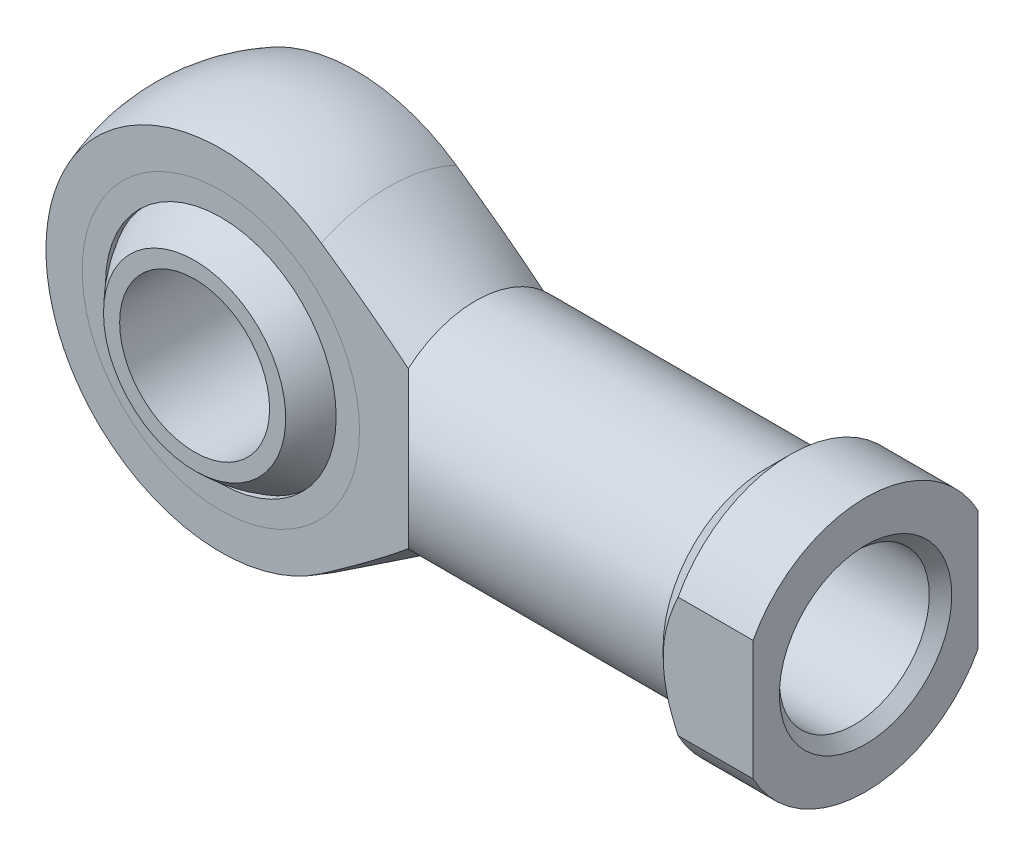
ISO-10303-21;
HEADER;
FILE_DESCRIPTION(('STEP AP214'),'2;1');
FILE_NAME('part.step','',(''),(''),'','','');
FILE_SCHEMA(('AUTOMOTIVE_DESIGN { 1 0 10303 214 1 1 1 1 }'));
ENDSEC;
DATA;
#1=APPLICATION_CONTEXT('core data for automotive mechanical design processes');
#2=APPLICATION_PROTOCOL_DEFINITION('international standard','automotive_design',2000,#1);
#3=PRODUCT_CONTEXT('',#1,'mechanical');
#4=PRODUCT('Part','Part','',(#3));
#5=PRODUCT_RELATED_PRODUCT_CATEGORY('part','',(#4));
#6=PRODUCT_DEFINITION_FORMATION('','',#4);
#7=PRODUCT_DEFINITION_CONTEXT('part definition',#1,'design');
#8=PRODUCT_DEFINITION('design','',#6,#7);
#9=PRODUCT_DEFINITION_SHAPE('','',#8);
#10=(LENGTH_UNIT() NAMED_UNIT(*) SI_UNIT(.MILLI.,.METRE.));
#11=(NAMED_UNIT(*) PLANE_ANGLE_UNIT() SI_UNIT($,.RADIAN.));
#12=(NAMED_UNIT(*) SI_UNIT($,.STERADIAN.) SOLID_ANGLE_UNIT());
#13=UNCERTAINTY_MEASURE_WITH_UNIT(LENGTH_MEASURE(1.E-05),#10,'distance_accuracy_value','');
#14=(GEOMETRIC_REPRESENTATION_CONTEXT(3) GLOBAL_UNCERTAINTY_ASSIGNED_CONTEXT((#13)) GLOBAL_UNIT_ASSIGNED_CONTEXT((#10,
#11,#12)) REPRESENTATION_CONTEXT('',''));
#15=CARTESIAN_POINT('',(0.,0.,0.));
#16=DIRECTION('',(0.,0.,1.));
#17=DIRECTION('',(1.,0.,0.));
#18=AXIS2_PLACEMENT_3D('',#15,#16,#17);
#19=CARTESIAN_POINT('',(0.,0.,0.));
#20=DIRECTION('',(0.,1.,0.));
#21=DIRECTION('',(1.,0.,0.));
#22=AXIS2_PLACEMENT_3D('',#19,#20,#21);
#23=SPHERICAL_SURFACE('',#22,17.435);
#24=CARTESIAN_POINT('',(0.,0.,0.));
#25=DIRECTION('',(0.,0.,-1.));
#26=DIRECTION('',(-1.,0.,0.));
#27=AXIS2_PLACEMENT_3D('',#24,#25,#26);
#28=SPHERICAL_SURFACE('',#27,17.435);
#29=CARTESIAN_POINT('',(0.,0.,12.5));
#30=DIRECTION('',(0.,0.,-1.));
#31=DIRECTION('',(-1.,0.,0.));
#32=AXIS2_PLACEMENT_3D('',#29,#30,#31);
#33=CIRCLE('',#32,12.154391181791);
#34=CARTESIAN_POINT('',(-12.154391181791,0.,12.5));
#35=VERTEX_POINT('',#34);
#36=EDGE_CURVE('P0_E26',#35,#35,#33,.F.);
#37=ORIENTED_EDGE('',*,*,#36,.F.);
#38=EDGE_LOOP('',(#37));
#39=FACE_BOUND('',#38,.T.);
#40=CARTESIAN_POINT('',(0.,0.,-12.5));
#41=DIRECTION('',(0.,0.,1.));
#42=DIRECTION('',(1.,0.,0.));
#43=AXIS2_PLACEMENT_3D('',#40,#41,#42);
#44=CIRCLE('',#43,12.154391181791);
#45=CARTESIAN_POINT('',(12.154391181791,0.,-12.5));
#46=VERTEX_POINT('',#45);
#47=EDGE_CURVE('P0_E10',#46,#46,#44,.F.);
#48=ORIENTED_EDGE('',*,*,#47,.F.);
#49=EDGE_LOOP('',(#48));
#50=FACE_BOUND('',#49,.T.);
#51=ADVANCED_FACE('P0_F14',(#39,#50),#28,.T.);
#52=CARTESIAN_POINT('',(0.,0.,-17.435));
#53=DIRECTION('',(0.,0.,1.));
#54=DIRECTION('',(1.,0.,0.));
#55=AXIS2_PLACEMENT_3D('',#52,#53,#54);
#56=CYLINDRICAL_SURFACE('',#55,10.);
#57=CARTESIAN_POINT('',(0.,0.,12.5));
#58=DIRECTION('',(0.,0.,-1.));
#59=DIRECTION('',(-1.,0.,0.));
#60=AXIS2_PLACEMENT_3D('',#57,#58,#59);
#61=CIRCLE('',#60,10.);
#62=CARTESIAN_POINT('',(-10.,0.,12.5));
#63=VERTEX_POINT('',#62);
#64=EDGE_CURVE('P0_E17',#63,#63,#61,.F.);
#65=ORIENTED_EDGE('',*,*,#64,.T.);
#66=EDGE_LOOP('',(#65));
#67=FACE_BOUND('',#66,.T.);
#68=CARTESIAN_POINT('',(0.,0.,-12.5));
#69=DIRECTION('',(0.,0.,1.));
#70=DIRECTION('',(1.,0.,0.));
#71=AXIS2_PLACEMENT_3D('',#68,#69,#70);
#72=CIRCLE('',#71,10.);
#73=CARTESIAN_POINT('',(10.,0.,-12.5));
#74=VERTEX_POINT('',#73);
#75=EDGE_CURVE('P0_E21',#74,#74,#72,.F.);
#76=ORIENTED_EDGE('',*,*,#75,.T.);
#77=EDGE_LOOP('',(#76));
#78=FACE_BOUND('',#77,.T.);
#79=ADVANCED_FACE('P0_F34',(#67,#78),#56,.F.);
#80=CARTESIAN_POINT('',(-17.435,-17.435,-12.5));
#81=DIRECTION('',(0.,0.,1.));
#82=DIRECTION('',(1.,0.,0.));
#83=AXIS2_PLACEMENT_3D('',#80,#81,#82);
#84=PLANE('',#83);
#85=ORIENTED_EDGE('',*,*,#47,.T.);
#86=EDGE_LOOP('',(#85));
#87=FACE_BOUND('',#86,.T.);
#88=ORIENTED_EDGE('',*,*,#75,.F.);
#89=EDGE_LOOP('',(#88));
#90=FACE_BOUND('',#89,.T.);
#91=ADVANCED_FACE('P0_F39',(#87,#90),#84,.F.);
#92=CARTESIAN_POINT('',(-17.435,-17.435,12.5));
#93=DIRECTION('',(0.,0.,-1.));
#94=DIRECTION('',(-1.,0.,0.));
#95=AXIS2_PLACEMENT_3D('',#92,#93,#94);
#96=PLANE('',#95);
#97=ORIENTED_EDGE('',*,*,#36,.T.);
#98=EDGE_LOOP('',(#97));
#99=FACE_BOUND('',#98,.T.);
#100=ORIENTED_EDGE('',*,*,#64,.F.);
#101=EDGE_LOOP('',(#100));
#102=FACE_BOUND('',#101,.T.);
#103=ADVANCED_FACE('P0_F37',(#99,#102),#96,.F.);
#104=CLOSED_SHELL('',(#51,#79,#91,#103));
#105=MANIFOLD_SOLID_BREP('P0_B1',#104);
#106=CARTESIAN_POINT('',(0.,0.,9.));
#107=DIRECTION('',(0.,0.,1.));
#108=DIRECTION('',(1.,0.,0.));
#109=AXIS2_PLACEMENT_3D('',#106,#107,#108);
#110=PLANE('',#109);
#111=CARTESIAN_POINT('',(0.,0.,9.));
#112=DIRECTION('',(0.,0.,1.));
#113=DIRECTION('',(1.,0.,0.));
#114=AXIS2_PLACEMENT_3D('',#111,#112,#113);
#115=CIRCLE('',#114,18.5);
#116=CARTESIAN_POINT('',(18.5,0.,9.));
#117=VERTEX_POINT('',#116);
#118=EDGE_CURVE('P1_E10',#117,#117,#115,.T.);
#119=ORIENTED_EDGE('',*,*,#118,.T.);
#120=EDGE_LOOP('',(#119));
#121=FACE_BOUND('',#120,.T.);
#122=CARTESIAN_POINT('',(0.,0.,9.));
#123=DIRECTION('',(0.,0.,1.));
#124=DIRECTION('',(1.,0.,0.));
#125=AXIS2_PLACEMENT_3D('',#122,#123,#124);
#126=CIRCLE('',#125,15.385);
#127=CARTESIAN_POINT('',(15.385,0.,9.));
#128=VERTEX_POINT('',#127);
#129=EDGE_CURVE('P1_E25',#128,#128,#126,.T.);
#130=ORIENTED_EDGE('',*,*,#129,.F.);
#131=EDGE_LOOP('',(#130));
#132=FACE_BOUND('',#131,.T.);
#133=ADVANCED_FACE('P1_F14',(#121,#132),#110,.T.);
#134=CARTESIAN_POINT('',(0.,0.,8.2));
#135=DIRECTION('',(0.,0.,1.));
#136=DIRECTION('',(1.,0.,0.));
#137=AXIS2_PLACEMENT_3D('',#134,#135,#136);
#138=PLANE('',#137);
#139=CARTESIAN_POINT('',(0.,0.,8.2));
#140=DIRECTION('',(0.,0.,1.));
#141=DIRECTION('',(1.,0.,0.));
#142=AXIS2_PLACEMENT_3D('',#139,#140,#141);
#143=CIRCLE('',#142,18.5);
#144=CARTESIAN_POINT('',(18.5,0.,8.2));
#145=VERTEX_POINT('',#144);
#146=EDGE_CURVE('P1_E18',#145,#145,#143,.T.);
#147=ORIENTED_EDGE('',*,*,#146,.F.);
#148=EDGE_LOOP('',(#147));
#149=FACE_BOUND('',#148,.T.);
#150=CARTESIAN_POINT('',(0.,0.,8.2));
#151=DIRECTION('',(0.,0.,1.));
#152=DIRECTION('',(1.,0.,0.));
#153=AXIS2_PLACEMENT_3D('',#150,#151,#152);
#154=CIRCLE('',#153,15.385);
#155=CARTESIAN_POINT('',(15.385,0.,8.2));
#156=VERTEX_POINT('',#155);
#157=EDGE_CURVE('P1_E27',#156,#156,#154,.T.);
#158=ORIENTED_EDGE('',*,*,#157,.T.);
#159=EDGE_LOOP('',(#158));
#160=FACE_BOUND('',#159,.T.);
#161=ADVANCED_FACE('P1_F37',(#149,#160),#138,.F.);
#162=CARTESIAN_POINT('',(0.,0.,9.));
#163=DIRECTION('',(0.,0.,-1.));
#164=DIRECTION('',(-1.,0.,0.));
#165=AXIS2_PLACEMENT_3D('',#162,#163,#164);
#166=CYLINDRICAL_SURFACE('',#165,18.5);
#167=ORIENTED_EDGE('',*,*,#118,.F.);
#168=EDGE_LOOP('',(#167));
#169=FACE_BOUND('',#168,.T.);
#170=ORIENTED_EDGE('',*,*,#146,.T.);
#171=EDGE_LOOP('',(#170));
#172=FACE_BOUND('',#171,.T.);
#173=ADVANCED_FACE('P1_F16',(#169,#172),#166,.T.);
#174=CARTESIAN_POINT('',(0.,0.,9.));
#175=DIRECTION('',(0.,0.,-1.));
#176=DIRECTION('',(-1.,0.,0.));
#177=AXIS2_PLACEMENT_3D('',#174,#175,#176);
#178=CYLINDRICAL_SURFACE('',#177,15.385);
#179=ORIENTED_EDGE('',*,*,#129,.T.);
#180=EDGE_LOOP('',(#179));
#181=FACE_BOUND('',#180,.T.);
#182=ORIENTED_EDGE('',*,*,#157,.F.);
#183=EDGE_LOOP('',(#182));
#184=FACE_BOUND('',#183,.T.);
#185=ADVANCED_FACE('P1_F33',(#181,#184),#178,.F.);
#186=CLOSED_SHELL('',(#133,#161,#173,#185));
#187=MANIFOLD_SOLID_BREP('P1_B1',#186);
#188=CARTESIAN_POINT('',(0.,0.,-8.2));
#189=DIRECTION('',(0.,0.,1.));
#190=DIRECTION('',(1.,0.,0.));
#191=AXIS2_PLACEMENT_3D('',#188,#189,#190);
#192=PLANE('',#191);
#193=CARTESIAN_POINT('',(0.,0.,-8.2));
#194=DIRECTION('',(0.,0.,1.));
#195=DIRECTION('',(1.,0.,0.));
#196=AXIS2_PLACEMENT_3D('',#193,#194,#195);
#197=CIRCLE('',#196,18.5);
#198=CARTESIAN_POINT('',(18.5,0.,-8.2));
#199=VERTEX_POINT('',#198);
#200=EDGE_CURVE('P2_E10',#199,#199,#197,.T.);
#201=ORIENTED_EDGE('',*,*,#200,.T.);
#202=EDGE_LOOP('',(#201));
#203=FACE_BOUND('',#202,.T.);
#204=CARTESIAN_POINT('',(0.,0.,-8.2));
#205=DIRECTION('',(0.,0.,1.));
#206=DIRECTION('',(1.,0.,0.));
#207=AXIS2_PLACEMENT_3D('',#204,#205,#206);
#208=CIRCLE('',#207,15.385);
#209=CARTESIAN_POINT('',(15.385,0.,-8.2));
#210=VERTEX_POINT('',#209);
#211=EDGE_CURVE('P2_E25',#210,#210,#208,.T.);
#212=ORIENTED_EDGE('',*,*,#211,.F.);
#213=EDGE_LOOP('',(#212));
#214=FACE_BOUND('',#213,.T.);
#215=ADVANCED_FACE('P2_F14',(#203,#214),#192,.T.);
#216=CARTESIAN_POINT('',(0.,0.,-9.));
#217=DIRECTION('',(0.,0.,1.));
#218=DIRECTION('',(1.,0.,0.));
#219=AXIS2_PLACEMENT_3D('',#216,#217,#218);
#220=PLANE('',#219);
#221=CARTESIAN_POINT('',(0.,0.,-9.));
#222=DIRECTION('',(0.,0.,1.));
#223=DIRECTION('',(1.,0.,0.));
#224=AXIS2_PLACEMENT_3D('',#221,#222,#223);
#225=CIRCLE('',#224,18.5);
#226=CARTESIAN_POINT('',(18.5,0.,-9.));
#227=VERTEX_POINT('',#226);
#228=EDGE_CURVE('P2_E18',#227,#227,#225,.T.);
#229=ORIENTED_EDGE('',*,*,#228,.F.);
#230=EDGE_LOOP('',(#229));
#231=FACE_BOUND('',#230,.T.);
#232=CARTESIAN_POINT('',(0.,0.,-9.));
#233=DIRECTION('',(0.,0.,1.));
#234=DIRECTION('',(1.,0.,0.));
#235=AXIS2_PLACEMENT_3D('',#232,#233,#234);
#236=CIRCLE('',#235,15.385);
#237=CARTESIAN_POINT('',(15.385,0.,-9.));
#238=VERTEX_POINT('',#237);
#239=EDGE_CURVE('P2_E27',#238,#238,#236,.T.);
#240=ORIENTED_EDGE('',*,*,#239,.T.);
#241=EDGE_LOOP('',(#240));
#242=FACE_BOUND('',#241,.T.);
#243=ADVANCED_FACE('P2_F37',(#231,#242),#220,.F.);
#244=CARTESIAN_POINT('',(0.,0.,-8.2));
#245=DIRECTION('',(0.,0.,-1.));
#246=DIRECTION('',(-1.,0.,0.));
#247=AXIS2_PLACEMENT_3D('',#244,#245,#246);
#248=CYLINDRICAL_SURFACE('',#247,18.5);
#249=ORIENTED_EDGE('',*,*,#200,.F.);
#250=EDGE_LOOP('',(#249));
#251=FACE_BOUND('',#250,.T.);
#252=ORIENTED_EDGE('',*,*,#228,.T.);
#253=EDGE_LOOP('',(#252));
#254=FACE_BOUND('',#253,.T.);
#255=ADVANCED_FACE('P2_F16',(#251,#254),#248,.T.);
#256=CARTESIAN_POINT('',(0.,0.,-8.2));
#257=DIRECTION('',(0.,0.,-1.));
#258=DIRECTION('',(-1.,0.,0.));
#259=AXIS2_PLACEMENT_3D('',#256,#257,#258);
#260=CYLINDRICAL_SURFACE('',#259,15.385);
#261=ORIENTED_EDGE('',*,*,#211,.T.);
#262=EDGE_LOOP('',(#261));
#263=FACE_BOUND('',#262,.T.);
#264=ORIENTED_EDGE('',*,*,#239,.F.);
#265=EDGE_LOOP('',(#264));
#266=FACE_BOUND('',#265,.T.);
#267=ADVANCED_FACE('P2_F33',(#263,#266),#260,.F.);
#268=CLOSED_SHELL('',(#215,#243,#255,#267));
#269=MANIFOLD_SOLID_BREP('P2_B1',#268);
#270=CARTESIAN_POINT('',(0.,0.,0.));
#271=DIRECTION('',(0.,1.,0.));
#272=DIRECTION('',(1.,0.,0.));
#273=AXIS2_PLACEMENT_3D('',#270,#271,#272);
#274=SPHERICAL_SURFACE('',#273,17.435);
#275=CARTESIAN_POINT('',(0.,0.,0.));
#276=DIRECTION('',(0.,0.,1.));
#277=DIRECTION('',(1.,0.,0.));
#278=AXIS2_PLACEMENT_3D('',#275,#276,#277);
#279=SPHERICAL_SURFACE('',#278,17.435);
#280=CARTESIAN_POINT('',(0.,0.,8.2));
#281=DIRECTION('',(0.,0.,1.));
#282=DIRECTION('',(1.,0.,0.));
#283=AXIS2_PLACEMENT_3D('',#280,#281,#282);
#284=CIRCLE('',#283,15.3863324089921);
#285=CARTESIAN_POINT('',(15.3863324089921,0.,8.2));
#286=VERTEX_POINT('',#285);
#287=EDGE_CURVE('P3_E73',#286,#286,#284,.F.);
#288=ORIENTED_EDGE('',*,*,#287,.F.);
#289=EDGE_LOOP('',(#288));
#290=FACE_BOUND('',#289,.T.);
#291=CARTESIAN_POINT('',(0.,0.,-8.2));
#292=DIRECTION('',(0.,0.,-1.));
#293=DIRECTION('',(-1.,0.,0.));
#294=AXIS2_PLACEMENT_3D('',#291,#292,#293);
#295=CIRCLE('',#294,15.3863324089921);
#296=CARTESIAN_POINT('',(-15.3863324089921,0.,-8.2));
#297=VERTEX_POINT('',#296);
#298=EDGE_CURVE('P3_E20',#297,#297,#295,.F.);
#299=ORIENTED_EDGE('',*,*,#298,.F.);
#300=EDGE_LOOP('',(#299));
#301=FACE_BOUND('',#300,.T.);
#302=ADVANCED_FACE('P3_F16',(#290,#301),#279,.F.);
#303=CARTESIAN_POINT('',(-25.,-25.,-9.));
#304=DIRECTION('',(0.,0.,1.));
#305=DIRECTION('',(1.,0.,0.));
#306=AXIS2_PLACEMENT_3D('',#303,#304,#305);
#307=PLANE('',#306);
#308=CARTESIAN_POINT('',(0.,0.,-9.));
#309=DIRECTION('',(0.,0.,1.));
#310=DIRECTION('',(1.,0.,0.));
#311=AXIS2_PLACEMENT_3D('',#308,#309,#310);
#312=CIRCLE('',#311,23.3238075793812);
#313=CARTESIAN_POINT('',(13.3877159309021,19.0989282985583,-9.));
#314=VERTEX_POINT('',#313);
#315=CARTESIAN_POINT('',(13.3877159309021,-19.0989282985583,-9.));
#316=VERTEX_POINT('',#315);
#317=EDGE_CURVE('P3_E11',#314,#316,#312,.T.);
#318=ORIENTED_EDGE('',*,*,#317,.F.);
#319=CARTESIAN_POINT('',(-12.8889317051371,-36.6872276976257,-9.));
#320=CARTESIAN_POINT('',(-12.1321373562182,-36.193119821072,-9.));
#321=CARTESIAN_POINT('',(-11.3755995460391,-35.6986190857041,-9.));
#322=CARTESIAN_POINT('',(-9.86311104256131,-34.708718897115,-9.));
#323=CARTESIAN_POINT('',(-9.10716034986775,-34.213319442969,-9.));
#324=CARTESIAN_POINT('',(-6.83987446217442,-32.7253242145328,-9.));
#325=CARTESIAN_POINT('',(-5.32953408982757,-31.7312112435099,-9.));
#326=CARTESIAN_POINT('',(-2.30058391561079,-29.7299291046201,-9.));
#327=CARTESIAN_POINT('',(-0.782001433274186,-28.7227185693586,-9.));
#328=CARTESIAN_POINT('',(2.24994915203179,-26.7013553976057,-9.));
#329=CARTESIAN_POINT('',(3.76331855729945,-25.6872047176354,-9.));
#330=CARTESIAN_POINT('',(6.22492846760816,-24.0256617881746,-9.));
#331=CARTESIAN_POINT('',(7.17522205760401,-23.3813123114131,-9.));
#332=CARTESIAN_POINT('',(9.07234669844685,-22.0875379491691,-9.));
#333=CARTESIAN_POINT('',(10.0191777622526,-21.4381130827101,-9.));
#334=CARTESIAN_POINT('',(11.9092168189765,-20.1321341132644,-9.));
#335=CARTESIAN_POINT('',(12.8524206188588,-19.4755739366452,-9.));
#336=CARTESIAN_POINT('',(14.7327448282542,-18.1539084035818,-9.));
#337=CARTESIAN_POINT('',(15.6698656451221,-17.4888036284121,-9.));
#338=CARTESIAN_POINT('',(17.066873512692,-16.4840873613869,-9.));
#339=CARTESIAN_POINT('',(17.5299227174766,-16.1488725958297,-9.));
#340=CARTESIAN_POINT('',(18.4535163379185,-15.4750121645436,-9.));
#341=CARTESIAN_POINT('',(18.914060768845,-15.1363665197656,-9.));
#342=CARTESIAN_POINT('',(19.8322575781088,-14.4548924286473,-9.));
#343=CARTESIAN_POINT('',(20.2899090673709,-14.1120627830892,-9.));
#344=CARTESIAN_POINT('',(21.2014825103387,-13.4214847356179,-9.));
#345=CARTESIAN_POINT('',(21.6554045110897,-13.0737363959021,-9.));
#346=CARTESIAN_POINT('',(22.5578540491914,-12.37280596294,-9.));
#347=CARTESIAN_POINT('',(23.0063891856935,-12.0196336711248,-9.));
#348=CARTESIAN_POINT('',(23.8975685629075,-11.3058570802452,-9.));
#349=CARTESIAN_POINT('',(24.3402124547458,-10.9452523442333,-9.));
#350=CARTESIAN_POINT('',(25.2175278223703,-10.2149095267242,-9.));
#351=CARTESIAN_POINT('',(25.6522033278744,-9.84517629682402,-9.));
#352=CARTESIAN_POINT('',(26.511126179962,-9.09381984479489,-9.));
#353=CARTESIAN_POINT('',(26.9353751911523,-8.71219854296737,-9.));
#354=CARTESIAN_POINT('',(27.4474468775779,-8.23393906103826,-9.));
#355=CARTESIAN_POINT('',(27.5421904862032,-8.14469072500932,-9.));
#356=CARTESIAN_POINT('',(27.7308473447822,-7.96531761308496,-9.));
#357=CARTESIAN_POINT('',(27.8247605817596,-7.87519282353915,-9.));
#358=CARTESIAN_POINT('',(28.1051624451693,-7.60340762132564,-9.));
#359=CARTESIAN_POINT('',(28.2903007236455,-7.42034801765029,-9.));
#360=CARTESIAN_POINT('',(28.6564497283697,-7.04979259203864,-9.));
#361=CARTESIAN_POINT('',(28.8374563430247,-6.86229269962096,-9.));
#362=CARTESIAN_POINT('',(29.1942638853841,-6.48239854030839,-9.));
#363=CARTESIAN_POINT('',(29.3700649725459,-6.2900044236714,-9.));
#364=CARTESIAN_POINT('',(29.7130010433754,-5.90219790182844,-9.));
#365=CARTESIAN_POINT('',(29.8802206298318,-5.70686057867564,-9.));
#366=CARTESIAN_POINT('',(30.2070223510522,-5.30990606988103,-9.));
#367=CARTESIAN_POINT('',(30.3666053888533,-5.10828963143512,-9.));
#368=CARTESIAN_POINT('',(30.6760550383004,-4.69813326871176,-9.));
#369=CARTESIAN_POINT('',(30.8259348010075,-4.48960332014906,-9.));
#370=CARTESIAN_POINT('',(31.1137108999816,-4.06447078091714,-9.));
#371=CARTESIAN_POINT('',(31.2516119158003,-3.84787139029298,-9.));
#372=CARTESIAN_POINT('',(31.4827328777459,-3.45577147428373,-9.));
#373=CARTESIAN_POINT('',(31.5789990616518,-3.28207214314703,-9.));
#374=CARTESIAN_POINT('',(31.760621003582,-2.9290075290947,-9.));
#375=CARTESIAN_POINT('',(31.8459765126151,-2.74964211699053,-9.));
#376=CARTESIAN_POINT('',(32.0034644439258,-2.38561240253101,-9.));
#377=CARTESIAN_POINT('',(32.075625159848,-2.20096044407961,-9.));
#378=CARTESIAN_POINT('',(32.2045971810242,-1.82638749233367,-9.));
#379=CARTESIAN_POINT('',(32.2614149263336,-1.63646874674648,-9.));
#380=CARTESIAN_POINT('',(32.3496503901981,-1.28338012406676,-9.));
#381=CARTESIAN_POINT('',(32.3836930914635,-1.12086765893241,-9.));
#382=CARTESIAN_POINT('',(32.4382783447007,-0.79358331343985,-9.));
#383=CARTESIAN_POINT('',(32.4588225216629,-0.628811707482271,-9.));
#384=CARTESIAN_POINT('',(32.4856479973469,-0.298045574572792,-9.));
#385=CARTESIAN_POINT('',(32.4919245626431,-0.132050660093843,-9.));
#386=CARTESIAN_POINT('',(32.4899528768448,0.199857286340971,-9.));
#387=CARTESIAN_POINT('',(32.4817041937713,0.365770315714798,-9.));
#388=CARTESIAN_POINT('',(32.4510443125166,0.695858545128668,-9.));
#389=CARTESIAN_POINT('',(32.4286678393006,0.860037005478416,-9.));
#390=CARTESIAN_POINT('',(32.370610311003,1.1860023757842,-9.));
#391=CARTESIAN_POINT('',(32.3349290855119,1.34778925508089,-9.));
#392=CARTESIAN_POINT('',(32.2514303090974,1.66819448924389,-9.));
#393=CARTESIAN_POINT('',(32.2036113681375,1.82681247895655,-9.));
#394=CARTESIAN_POINT('',(32.0971825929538,2.140364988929,-9.));
#395=CARTESIAN_POINT('',(32.0385715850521,2.29529910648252,-9.));
#396=CARTESIAN_POINT('',(31.8633760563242,2.71851763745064,-9.));
#397=CARTESIAN_POINT('',(31.7367852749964,2.98267664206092,-9.));
#398=CARTESIAN_POINT('',(31.4609833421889,3.49891547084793,-9.));
#399=CARTESIAN_POINT('',(31.3117527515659,3.75098466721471,-9.));
#400=CARTESIAN_POINT('',(30.9953343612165,4.24525324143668,-9.));
#401=CARTESIAN_POINT('',(30.8280617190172,4.48739787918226,-9.));
#402=CARTESIAN_POINT('',(30.5672558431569,4.84317986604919,-9.));
#403=CARTESIAN_POINT('',(30.4786867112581,4.96051569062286,-9.));
#404=CARTESIAN_POINT('',(30.2986179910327,5.19291708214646,-9.));
#405=CARTESIAN_POINT('',(30.207118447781,5.30798268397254,-9.));
#406=CARTESIAN_POINT('',(29.9384065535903,5.63817589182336,-9.));
#407=CARTESIAN_POINT('',(29.7578507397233,5.85058537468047,-9.));
#408=CARTESIAN_POINT('',(29.3893662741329,6.26893382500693,-9.));
#409=CARTESIAN_POINT('',(29.2014362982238,6.47487161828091,-9.));
#410=CARTESIAN_POINT('',(28.8195206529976,6.88127617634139,-9.));
#411=CARTESIAN_POINT('',(28.625531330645,7.08173949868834,-9.));
#412=CARTESIAN_POINT('',(28.2326768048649,7.47784227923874,-9.));
#413=CARTESIAN_POINT('',(28.0338112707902,7.67348140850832,-9.));
#414=CARTESIAN_POINT('',(27.6315451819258,8.06105638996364,-9.));
#415=CARTESIAN_POINT('',(27.4281344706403,8.25298167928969,-9.));
#416=CARTESIAN_POINT('',(27.0179116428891,8.63316696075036,-9.));
#417=CARTESIAN_POINT('',(26.8110994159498,8.82142683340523,-9.));
#418=CARTESIAN_POINT('',(26.1865273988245,9.38127340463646,-9.));
#419=CARTESIAN_POINT('',(25.7644766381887,9.7480754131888,-9.));
#420=CARTESIAN_POINT('',(24.9084508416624,10.4747761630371,-9.));
#421=CARTESIAN_POINT('',(24.4744057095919,10.8345918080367,-9.));
#422=CARTESIAN_POINT('',(23.599805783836,11.5462710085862,-9.));
#423=CARTESIAN_POINT('',(23.1592505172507,11.8981339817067,-9.));
#424=CARTESIAN_POINT('',(22.2738333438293,12.5948668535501,-9.));
#425=CARTESIAN_POINT('',(21.8289797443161,12.9397473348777,-9.));
#426=CARTESIAN_POINT('',(20.9352870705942,13.624269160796,-9.));
#427=CARTESIAN_POINT('',(20.4864481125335,13.9639106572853,-9.));
#428=CARTESIAN_POINT('',(19.3553260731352,14.8113608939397,-9.));
#429=CARTESIAN_POINT('',(18.6709709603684,15.3164023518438,-9.));
#430=CARTESIAN_POINT('',(17.2967541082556,16.3189470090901,-9.));
#431=CARTESIAN_POINT('',(16.6068922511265,16.8164500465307,-9.));
#432=CARTESIAN_POINT('',(15.2228792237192,17.8055581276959,-9.));
#433=CARTESIAN_POINT('',(14.5287277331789,18.2971627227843,-9.));
#434=CARTESIAN_POINT('',(13.1370856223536,19.2756240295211,-9.));
#435=CARTESIAN_POINT('',(12.4395949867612,19.7624807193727,-9.));
#436=CARTESIAN_POINT('',(11.0412337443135,20.7328194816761,-9.));
#437=CARTESIAN_POINT('',(10.3403604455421,21.2162976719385,-9.));
#438=CARTESIAN_POINT('',(8.93642088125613,22.1800596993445,-9.));
#439=CARTESIAN_POINT('',(8.23335461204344,22.6603435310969,-9.));
#440=CARTESIAN_POINT('',(6.12152080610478,24.0971814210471,-9.));
#441=CARTESIAN_POINT('',(4.71005324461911,25.0497668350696,-9.));
#442=CARTESIAN_POINT('',(1.95290998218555,26.8998147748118,-9.));
#443=CARTESIAN_POINT('',(0.607482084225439,27.7976473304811,-9.));
#444=CARTESIAN_POINT('',(-2.08682584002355,29.5881557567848,-9.));
#445=CARTESIAN_POINT('',(-3.43570591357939,30.4808315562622,-9.));
#446=CARTESIAN_POINT('',(-6.1341586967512,32.2609138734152,-9.));
#447=CARTESIAN_POINT('',(-7.48372763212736,33.1483261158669,-9.));
#448=CARTESIAN_POINT('',(-9.50961470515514,34.4770762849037,-9.));
#449=CARTESIAN_POINT('',(-10.1851594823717,34.9195940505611,-9.));
#450=CARTESIAN_POINT('',(-11.536711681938,35.8039218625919,-9.));
#451=CARTESIAN_POINT('',(-12.2127191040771,36.2457319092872,-9.));
#452=CARTESIAN_POINT('',(-12.8889317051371,36.6872276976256,-9.));
#453=B_SPLINE_CURVE_WITH_KNOTS('',3,(#319,#320,#321,#322,#323,#324,#325,#326,#327,#328,#329,
#330,#331,#332,#333,#334,#335,#336,#337,#338,#339,#340,#341,#342,#343,#344,#345,#346,#347,#348,
#349,#350,#351,#352,#353,#354,#355,#356,#357,#358,#359,#360,#361,#362,#363,#364,#365,#366,#367,
#368,#369,#370,#371,#372,#373,#374,#375,#376,#377,#378,#379,#380,#381,#382,#383,#384,#385,#386,
#387,#388,#389,#390,#391,#392,#393,#394,#395,#396,#397,#398,#399,#400,#401,#402,#403,#404,#405,
#406,#407,#408,#409,#410,#411,#412,#413,#414,#415,#416,#417,#418,#419,#420,#421,#422,#423,#424,
#425,#426,#427,#428,#429,#430,#431,#432,#433,#434,#435,#436,#437,#438,#439,#440,#441,#442,#443,
#444,#445,#446,#447,#448,#449,#450,#451,#452),.UNSPECIFIED.,.F.,.F.,(4,2,2,2,2,2,2,2,2,2,2,2,2,
2,2,2,2,2,2,2,2,2,2,2,2,2,2,2,2,2,2,2,2,2,2,2,2,2,2,2,2,2,2,2,2,2,2,2,2,2,2,2,2,2,2,2,2,2,2,2,2,
2,2,2,2,2,4),(0.,2.71144260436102,5.42288799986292,10.8473141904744,16.314026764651,
21.7792569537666,25.2236893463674,28.6681088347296,32.1157346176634,35.5631270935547,
37.2780642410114,38.9929909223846,40.708421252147,42.4238299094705,44.1364371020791,
45.8491452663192,47.5609619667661,49.2725035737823,49.6629791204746,50.0534607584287,
50.8344752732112,51.616235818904,52.3979723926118,53.1692250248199,53.9403862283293,
54.7104793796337,55.4802703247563,56.0757299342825,56.6712031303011,57.2653840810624,
57.8593152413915,58.3569186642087,58.8544621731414,59.3521707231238,59.8498940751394,
60.3463988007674,60.8429098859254,61.3394778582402,61.8360998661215,62.7133073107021,
63.5912722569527,64.4735623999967,64.9145599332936,65.3555506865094,66.1916574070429,
67.0279149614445,67.8646867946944,68.7015155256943,69.5404509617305,70.3794136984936,
72.0566944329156,73.7479649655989,75.4393589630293,77.12796158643,78.8165151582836,
81.3680443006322,83.9196281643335,86.4714048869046,89.0231933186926,91.5775456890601,
94.1319023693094,99.2403785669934,104.092840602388,108.945369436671,113.79093206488,
116.21366662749,118.636400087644),.UNSPECIFIED.);
#454=CARTESIAN_POINT('',(25.,10.3953114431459,-9.));
#455=VERTEX_POINT('',#454);
#456=EDGE_CURVE('P3_E102',#455,#314,#453,.T.);
#457=ORIENTED_EDGE('',*,*,#456,.F.);
#458=DIRECTION('',(0.,1.,0.));
#459=VECTOR('',#458,1.);
#460=CARTESIAN_POINT('',(25.,-25.,-9.));
#461=LINE('',#460,#459);
#462=CARTESIAN_POINT('',(25.,-10.3953114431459,-9.));
#463=VERTEX_POINT('',#462);
#464=EDGE_CURVE('P3_E64',#463,#455,#461,.T.);
#465=ORIENTED_EDGE('',*,*,#464,.F.);
#466=EDGE_CURVE('P3_E33',#316,#463,#453,.T.);
#467=ORIENTED_EDGE('',*,*,#466,.F.);
#468=EDGE_LOOP('',(#318,#457,#465,#467));
#469=FACE_BOUND('',#468,.T.);
#470=CARTESIAN_POINT('',(0.,0.,-9.));
#471=DIRECTION('',(0.,0.,1.));
#472=DIRECTION('',(1.,0.,0.));
#473=AXIS2_PLACEMENT_3D('',#470,#471,#472);
#474=CIRCLE('',#473,18.5);
#475=CARTESIAN_POINT('',(18.5,0.,-9.));
#476=VERTEX_POINT('',#475);
#477=EDGE_CURVE('P3_E95',#476,#476,#474,.T.);
#478=ORIENTED_EDGE('',*,*,#477,.T.);
#479=EDGE_LOOP('',(#478));
#480=FACE_BOUND('',#479,.T.);
#481=ADVANCED_FACE('P3_F115',(#469,#480),#307,.F.);
#482=CARTESIAN_POINT('',(25.,0.,0.));
#483=DIRECTION('',(-1.,0.,0.));
#484=DIRECTION('',(0.,0.,1.));
#485=AXIS2_PLACEMENT_3D('',#482,#483,#484);
#486=CONICAL_SURFACE('',#485,13.75,0.565109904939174);
#487=CARTESIAN_POINT('',(13.3877159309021,0.,0.));
#488=DIRECTION('',(-1.,0.,0.));
#489=DIRECTION('',(0.,0.,1.));
#490=AXIS2_PLACEMENT_3D('',#487,#488,#489);
#491=CIRCLE('',#490,21.1132437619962);
#492=CARTESIAN_POINT('',(13.3877159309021,-19.0989282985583,9.));
#493=VERTEX_POINT('',#492);
#494=EDGE_CURVE('P3_E79',#316,#493,#491,.T.);
#495=ORIENTED_EDGE('',*,*,#494,.F.);
#496=ORIENTED_EDGE('',*,*,#466,.T.);
#497=CARTESIAN_POINT('',(25.,0.,0.));
#498=DIRECTION('',(-1.,0.,0.));
#499=DIRECTION('',(0.,0.,1.));
#500=AXIS2_PLACEMENT_3D('',#497,#498,#499);
#501=CIRCLE('',#500,13.75);
#502=CARTESIAN_POINT('',(25.,-10.3953114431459,9.));
#503=VERTEX_POINT('',#502);
#504=EDGE_CURVE('P3_E70',#463,#503,#501,.T.);
#505=ORIENTED_EDGE('',*,*,#504,.T.);
#506=CARTESIAN_POINT('',(-12.8889317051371,36.6872276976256,9.));
#507=CARTESIAN_POINT('',(-12.1321373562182,36.1931198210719,9.));
#508=CARTESIAN_POINT('',(-11.3755995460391,35.6986190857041,9.));
#509=CARTESIAN_POINT('',(-9.8631110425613,34.708718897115,9.));
#510=CARTESIAN_POINT('',(-9.10716034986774,34.213319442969,9.));
#511=CARTESIAN_POINT('',(-6.83987446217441,32.7253242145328,9.));
#512=CARTESIAN_POINT('',(-5.32953408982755,31.7312112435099,9.));
#513=CARTESIAN_POINT('',(-2.30058391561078,29.7299291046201,9.));
#514=CARTESIAN_POINT('',(-0.782001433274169,28.7227185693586,9.));
#515=CARTESIAN_POINT('',(2.24994915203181,26.7013553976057,9.));
#516=CARTESIAN_POINT('',(3.76331855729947,25.6872047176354,9.));
#517=CARTESIAN_POINT('',(6.22492846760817,24.0256617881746,9.));
#518=CARTESIAN_POINT('',(7.17522205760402,23.3813123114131,9.));
#519=CARTESIAN_POINT('',(9.07234669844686,22.0875379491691,9.));
#520=CARTESIAN_POINT('',(10.0191777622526,21.4381130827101,9.));
#521=CARTESIAN_POINT('',(11.9092168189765,20.1321341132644,9.));
#522=CARTESIAN_POINT('',(12.8524206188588,19.4755739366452,9.));
#523=CARTESIAN_POINT('',(14.7327448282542,18.1539084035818,9.));
#524=CARTESIAN_POINT('',(15.6698656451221,17.4888036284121,9.));
#525=CARTESIAN_POINT('',(17.066873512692,16.4840873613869,9.));
#526=CARTESIAN_POINT('',(17.5299227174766,16.1488725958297,9.));
#527=CARTESIAN_POINT('',(18.4535163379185,15.4750121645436,9.));
#528=CARTESIAN_POINT('',(18.914060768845,15.1363665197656,9.));
#529=CARTESIAN_POINT('',(19.8322575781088,14.4548924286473,9.));
#530=CARTESIAN_POINT('',(20.2899090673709,14.1120627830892,9.));
#531=CARTESIAN_POINT('',(21.2014825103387,13.4214847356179,9.));
#532=CARTESIAN_POINT('',(21.6554045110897,13.0737363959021,9.));
#533=CARTESIAN_POINT('',(22.5578540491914,12.37280596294,9.));
#534=CARTESIAN_POINT('',(23.0063891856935,12.0196336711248,9.));
#535=CARTESIAN_POINT('',(23.8975685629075,11.3058570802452,9.));
#536=CARTESIAN_POINT('',(24.3402124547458,10.9452523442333,9.));
#537=CARTESIAN_POINT('',(25.2175278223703,10.2149095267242,9.));
#538=CARTESIAN_POINT('',(25.6522033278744,9.84517629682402,9.));
#539=CARTESIAN_POINT('',(26.511126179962,9.09381984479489,9.));
#540=CARTESIAN_POINT('',(26.9353751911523,8.71219854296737,9.));
#541=CARTESIAN_POINT('',(27.4474468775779,8.23393906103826,9.));
#542=CARTESIAN_POINT('',(27.5421904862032,8.14469072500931,9.));
#543=CARTESIAN_POINT('',(27.7308473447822,7.96531761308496,9.));
#544=CARTESIAN_POINT('',(27.8247605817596,7.87519282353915,9.));
#545=CARTESIAN_POINT('',(28.1051624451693,7.60340762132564,9.));
#546=CARTESIAN_POINT('',(28.2903007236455,7.42034801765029,9.));
#547=CARTESIAN_POINT('',(28.6564497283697,7.04979259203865,9.));
#548=CARTESIAN_POINT('',(28.8374563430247,6.86229269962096,9.));
#549=CARTESIAN_POINT('',(29.1942638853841,6.48239854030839,9.));
#550=CARTESIAN_POINT('',(29.3700649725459,6.2900044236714,9.));
#551=CARTESIAN_POINT('',(29.7130010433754,5.90219790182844,9.));
#552=CARTESIAN_POINT('',(29.8802206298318,5.70686057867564,9.));
#553=CARTESIAN_POINT('',(30.2070223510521,5.30990606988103,9.));
#554=CARTESIAN_POINT('',(30.3666053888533,5.10828963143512,9.));
#555=CARTESIAN_POINT('',(30.6760550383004,4.69813326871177,9.));
#556=CARTESIAN_POINT('',(30.8259348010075,4.48960332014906,9.));
#557=CARTESIAN_POINT('',(31.1137108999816,4.06447078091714,9.));
#558=CARTESIAN_POINT('',(31.2516119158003,3.84787139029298,9.));
#559=CARTESIAN_POINT('',(31.4827328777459,3.45577147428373,9.));
#560=CARTESIAN_POINT('',(31.5789990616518,3.28207214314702,9.));
#561=CARTESIAN_POINT('',(31.760621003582,2.9290075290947,9.));
#562=CARTESIAN_POINT('',(31.8459765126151,2.74964211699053,9.));
#563=CARTESIAN_POINT('',(32.0034644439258,2.38561240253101,9.));
#564=CARTESIAN_POINT('',(32.075625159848,2.20096044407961,9.));
#565=CARTESIAN_POINT('',(32.2045971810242,1.82638749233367,9.));
#566=CARTESIAN_POINT('',(32.2614149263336,1.63646874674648,9.));
#567=CARTESIAN_POINT('',(32.3496503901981,1.28338012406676,9.));
#568=CARTESIAN_POINT('',(32.3836930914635,1.12086765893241,9.));
#569=CARTESIAN_POINT('',(32.4382783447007,0.793583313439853,9.));
#570=CARTESIAN_POINT('',(32.4588225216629,0.628811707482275,9.));
#571=CARTESIAN_POINT('',(32.4856479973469,0.298045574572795,9.));
#572=CARTESIAN_POINT('',(32.4919245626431,0.132050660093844,9.));
#573=CARTESIAN_POINT('',(32.4899528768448,-0.199857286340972,9.));
#574=CARTESIAN_POINT('',(32.4817041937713,-0.365770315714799,9.));
#575=CARTESIAN_POINT('',(32.4510443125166,-0.695858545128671,9.));
#576=CARTESIAN_POINT('',(32.4286678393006,-0.860037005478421,9.));
#577=CARTESIAN_POINT('',(32.370610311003,-1.18600237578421,9.));
#578=CARTESIAN_POINT('',(32.3349290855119,-1.3477892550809,9.));
#579=CARTESIAN_POINT('',(32.2514303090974,-1.66819448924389,9.));
#580=CARTESIAN_POINT('',(32.2036113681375,-1.82681247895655,9.));
#581=CARTESIAN_POINT('',(32.0971825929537,-2.140364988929,9.));
#582=CARTESIAN_POINT('',(32.0385715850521,-2.29529910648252,9.));
#583=CARTESIAN_POINT('',(31.8633760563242,-2.71851763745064,9.));
#584=CARTESIAN_POINT('',(31.7367852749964,-2.98267664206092,9.));
#585=CARTESIAN_POINT('',(31.4609833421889,-3.49891547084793,9.));
#586=CARTESIAN_POINT('',(31.3117527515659,-3.75098466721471,9.));
#587=CARTESIAN_POINT('',(30.9953343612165,-4.24525324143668,9.));
#588=CARTESIAN_POINT('',(30.8280617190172,-4.48739787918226,9.));
#589=CARTESIAN_POINT('',(30.5672558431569,-4.84317986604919,9.));
#590=CARTESIAN_POINT('',(30.4786867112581,-4.96051569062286,9.));
#591=CARTESIAN_POINT('',(30.2986179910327,-5.19291708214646,9.));
#592=CARTESIAN_POINT('',(30.207118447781,-5.30798268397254,9.));
#593=CARTESIAN_POINT('',(29.9384065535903,-5.63817589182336,9.));
#594=CARTESIAN_POINT('',(29.7578507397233,-5.85058537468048,9.));
#595=CARTESIAN_POINT('',(29.3893662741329,-6.26893382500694,9.));
#596=CARTESIAN_POINT('',(29.2014362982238,-6.47487161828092,9.));
#597=CARTESIAN_POINT('',(28.8195206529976,-6.8812761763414,9.));
#598=CARTESIAN_POINT('',(28.625531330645,-7.08173949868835,9.));
#599=CARTESIAN_POINT('',(28.2326768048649,-7.47784227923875,9.));
#600=CARTESIAN_POINT('',(28.0338112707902,-7.67348140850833,9.));
#601=CARTESIAN_POINT('',(27.6315451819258,-8.06105638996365,9.));
#602=CARTESIAN_POINT('',(27.4281344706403,-8.2529816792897,9.));
#603=CARTESIAN_POINT('',(27.0179116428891,-8.63316696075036,9.));
#604=CARTESIAN_POINT('',(26.8110994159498,-8.82142683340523,9.));
#605=CARTESIAN_POINT('',(26.1865273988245,-9.38127340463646,9.));
#606=CARTESIAN_POINT('',(25.7644766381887,-9.74807541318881,9.));
#607=CARTESIAN_POINT('',(24.9084508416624,-10.4747761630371,9.));
#608=CARTESIAN_POINT('',(24.4744057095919,-10.8345918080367,9.));
#609=CARTESIAN_POINT('',(23.599805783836,-11.5462710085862,9.));
#610=CARTESIAN_POINT('',(23.1592505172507,-11.8981339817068,9.));
#611=CARTESIAN_POINT('',(22.2738333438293,-12.5948668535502,9.));
#612=CARTESIAN_POINT('',(21.8289797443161,-12.9397473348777,9.));
#613=CARTESIAN_POINT('',(20.9352870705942,-13.624269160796,9.));
#614=CARTESIAN_POINT('',(20.4864481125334,-13.9639106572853,9.));
#615=CARTESIAN_POINT('',(19.3553260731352,-14.8113608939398,9.));
#616=CARTESIAN_POINT('',(18.6709709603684,-15.3164023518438,9.));
#617=CARTESIAN_POINT('',(17.2967541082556,-16.3189470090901,9.));
#618=CARTESIAN_POINT('',(16.6068922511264,-16.8164500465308,9.));
#619=CARTESIAN_POINT('',(15.2228792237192,-17.8055581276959,9.));
#620=CARTESIAN_POINT('',(14.5287277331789,-18.2971627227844,9.));
#621=CARTESIAN_POINT('',(13.1370856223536,-19.2756240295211,9.));
#622=CARTESIAN_POINT('',(12.4395949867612,-19.7624807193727,9.));
#623=CARTESIAN_POINT('',(11.0412337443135,-20.7328194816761,9.));
#624=CARTESIAN_POINT('',(10.3403604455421,-21.2162976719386,9.));
#625=CARTESIAN_POINT('',(8.93642088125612,-22.1800596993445,9.));
#626=CARTESIAN_POINT('',(8.23335461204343,-22.6603435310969,9.));
#627=CARTESIAN_POINT('',(6.12152080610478,-24.0971814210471,9.));
#628=CARTESIAN_POINT('',(4.71005324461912,-25.0497668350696,9.));
#629=CARTESIAN_POINT('',(1.95290998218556,-26.8998147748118,9.));
#630=CARTESIAN_POINT('',(0.60748208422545,-27.7976473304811,9.));
#631=CARTESIAN_POINT('',(-2.08682584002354,-29.5881557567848,9.));
#632=CARTESIAN_POINT('',(-3.43570591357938,-30.4808315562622,9.));
#633=CARTESIAN_POINT('',(-6.1341586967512,-32.2609138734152,9.));
#634=CARTESIAN_POINT('',(-7.48372763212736,-33.1483261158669,9.));
#635=CARTESIAN_POINT('',(-9.50961470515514,-34.4770762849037,9.));
#636=CARTESIAN_POINT('',(-10.1851594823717,-34.9195940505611,9.));
#637=CARTESIAN_POINT('',(-11.536711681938,-35.8039218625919,9.));
#638=CARTESIAN_POINT('',(-12.2127191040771,-36.2457319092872,9.));
#639=CARTESIAN_POINT('',(-12.8889317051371,-36.6872276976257,9.));
#640=B_SPLINE_CURVE_WITH_KNOTS('',3,(#506,#507,#508,#509,#510,#511,#512,#513,#514,#515,#516,
#517,#518,#519,#520,#521,#522,#523,#524,#525,#526,#527,#528,#529,#530,#531,#532,#533,#534,#535,
#536,#537,#538,#539,#540,#541,#542,#543,#544,#545,#546,#547,#548,#549,#550,#551,#552,#553,#554,
#555,#556,#557,#558,#559,#560,#561,#562,#563,#564,#565,#566,#567,#568,#569,#570,#571,#572,#573,
#574,#575,#576,#577,#578,#579,#580,#581,#582,#583,#584,#585,#586,#587,#588,#589,#590,#591,#592,
#593,#594,#595,#596,#597,#598,#599,#600,#601,#602,#603,#604,#605,#606,#607,#608,#609,#610,#611,
#612,#613,#614,#615,#616,#617,#618,#619,#620,#621,#622,#623,#624,#625,#626,#627,#628,#629,#630,
#631,#632,#633,#634,#635,#636,#637,#638,#639),.UNSPECIFIED.,.F.,.F.,(4,2,2,2,2,2,2,2,2,2,2,2,2,
2,2,2,2,2,2,2,2,2,2,2,2,2,2,2,2,2,2,2,2,2,2,2,2,2,2,2,2,2,2,2,2,2,2,2,2,2,2,2,2,2,2,2,2,2,2,2,2,
2,2,2,2,2,4),(0.,2.71144260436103,5.42288799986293,10.8473141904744,16.314026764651,
21.7792569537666,25.2236893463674,28.6681088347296,32.1157346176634,35.5631270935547,
37.2780642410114,38.9929909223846,40.708421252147,42.4238299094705,44.1364371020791,
45.8491452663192,47.5609619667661,49.2725035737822,49.6629791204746,50.0534607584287,
50.8344752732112,51.616235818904,52.3979723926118,53.1692250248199,53.9403862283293,
54.7104793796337,55.4802703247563,56.0757299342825,56.6712031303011,57.2653840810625,
57.8593152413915,58.3569186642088,58.8544621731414,59.3521707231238,59.8498940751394,
60.3463988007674,60.8429098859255,61.3394778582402,61.8360998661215,62.7133073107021,
63.5912722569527,64.4735623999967,64.9145599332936,65.3555506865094,66.1916574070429,
67.0279149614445,67.8646867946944,68.7015155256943,69.5404509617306,70.3794136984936,
72.0566944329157,73.7479649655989,75.4393589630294,77.12796158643,78.8165151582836,
81.3680443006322,83.9196281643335,86.4714048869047,89.0231933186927,91.5775456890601,
94.1319023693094,99.2403785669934,104.092840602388,108.945369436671,113.79093206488,
116.21366662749,118.636400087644),.UNSPECIFIED.);
#641=EDGE_CURVE('P3_E56',#503,#493,#640,.T.);
#642=ORIENTED_EDGE('',*,*,#641,.T.);
#643=EDGE_LOOP('',(#495,#496,#505,#642));
#644=FACE_BOUND('',#643,.T.);
#645=ADVANCED_FACE('P3_F75',(#644),#486,.T.);
#646=CARTESIAN_POINT('',(25.,0.,0.));
#647=DIRECTION('',(-1.,0.,0.));
#648=DIRECTION('',(0.,0.,1.));
#649=AXIS2_PLACEMENT_3D('',#646,#647,#648);
#650=PLANE('',#649);
#651=ORIENTED_EDGE('',*,*,#504,.F.);
#652=ORIENTED_EDGE('',*,*,#464,.T.);
#653=CARTESIAN_POINT('',(25.,10.3953114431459,9.));
#654=VERTEX_POINT('',#653);
#655=EDGE_CURVE('P3_E72',#654,#455,#501,.T.);
#656=ORIENTED_EDGE('',*,*,#655,.F.);
#657=DIRECTION('',(0.,1.,0.));
#658=VECTOR('',#657,1.);
#659=CARTESIAN_POINT('',(25.,-25.,9.));
#660=LINE('',#659,#658);
#661=EDGE_CURVE('P3_E59',#503,#654,#660,.T.);
#662=ORIENTED_EDGE('',*,*,#661,.F.);
#663=EDGE_LOOP('',(#651,#652,#656,#662));
#664=FACE_BOUND('',#663,.T.);
#665=ADVANCED_FACE('P3_F18',(#664),#650,.F.);
#666=ORIENTED_EDGE('',*,*,#655,.T.);
#667=ORIENTED_EDGE('',*,*,#456,.T.);
#668=CARTESIAN_POINT('',(13.3877159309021,19.0989282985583,9.));
#669=VERTEX_POINT('',#668);
#670=EDGE_CURVE('P3_E76',#669,#314,#491,.T.);
#671=ORIENTED_EDGE('',*,*,#670,.F.);
#672=EDGE_CURVE('P3_E40',#669,#654,#640,.T.);
#673=ORIENTED_EDGE('',*,*,#672,.T.);
#674=EDGE_LOOP('',(#666,#667,#671,#673));
#675=FACE_BOUND('',#674,.T.);
#676=ADVANCED_FACE('P3_F107',(#675),#486,.T.);
#677=CARTESIAN_POINT('',(0.,0.,0.));
#678=DIRECTION('',(-1.,0.,0.));
#679=DIRECTION('',(0.,1.,0.));
#680=AXIS2_PLACEMENT_3D('',#677,#678,#679);
#681=SPHERICAL_SURFACE('',#680,25.);
#682=ORIENTED_EDGE('',*,*,#670,.T.);
#683=ORIENTED_EDGE('',*,*,#317,.T.);
#684=ORIENTED_EDGE('',*,*,#494,.T.);
#685=CARTESIAN_POINT('',(0.,0.,9.));
#686=DIRECTION('',(0.,0.,-1.));
#687=DIRECTION('',(-1.,0.,0.));
#688=AXIS2_PLACEMENT_3D('',#685,#686,#687);
#689=CIRCLE('',#688,23.3238075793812);
#690=EDGE_CURVE('P3_E25',#493,#669,#689,.T.);
#691=ORIENTED_EDGE('',*,*,#690,.T.);
#692=EDGE_LOOP('',(#682,#683,#684,#691));
#693=FACE_BOUND('',#692,.T.);
#694=ADVANCED_FACE('P3_F113',(#693),#681,.T.);
#695=CARTESIAN_POINT('',(-25.,-25.,9.));
#696=DIRECTION('',(0.,0.,-1.));
#697=DIRECTION('',(-1.,0.,0.));
#698=AXIS2_PLACEMENT_3D('',#695,#696,#697);
#699=PLANE('',#698);
#700=CARTESIAN_POINT('',(0.,0.,9.));
#701=DIRECTION('',(0.,0.,1.));
#702=DIRECTION('',(1.,0.,0.));
#703=AXIS2_PLACEMENT_3D('',#700,#701,#702);
#704=CIRCLE('',#703,18.5);
#705=CARTESIAN_POINT('',(18.5,0.,9.));
#706=VERTEX_POINT('',#705);
#707=EDGE_CURVE('P3_E88',#706,#706,#704,.T.);
#708=ORIENTED_EDGE('',*,*,#707,.F.);
#709=EDGE_LOOP('',(#708));
#710=FACE_BOUND('',#709,.T.);
#711=ORIENTED_EDGE('',*,*,#690,.F.);
#712=ORIENTED_EDGE('',*,*,#641,.F.);
#713=ORIENTED_EDGE('',*,*,#661,.T.);
#714=ORIENTED_EDGE('',*,*,#672,.F.);
#715=EDGE_LOOP('',(#711,#712,#713,#714));
#716=FACE_BOUND('',#715,.T.);
#717=ADVANCED_FACE('P3_F58',(#710,#716),#699,.F.);
#718=CARTESIAN_POINT('',(0.,0.,8.2));
#719=DIRECTION('',(0.,0.,1.));
#720=DIRECTION('',(1.,0.,0.));
#721=AXIS2_PLACEMENT_3D('',#718,#719,#720);
#722=PLANE('',#721);
#723=CARTESIAN_POINT('',(0.,0.,8.2));
#724=DIRECTION('',(0.,0.,1.));
#725=DIRECTION('',(1.,0.,0.));
#726=AXIS2_PLACEMENT_3D('',#723,#724,#725);
#727=CIRCLE('',#726,18.5);
#728=CARTESIAN_POINT('',(18.5,0.,8.2));
#729=VERTEX_POINT('',#728);
#730=EDGE_CURVE('P3_E84',#729,#729,#727,.T.);
#731=ORIENTED_EDGE('',*,*,#730,.T.);
#732=EDGE_LOOP('',(#731));
#733=FACE_BOUND('',#732,.T.);
#734=ORIENTED_EDGE('',*,*,#287,.T.);
#735=EDGE_LOOP('',(#734));
#736=FACE_BOUND('',#735,.T.);
#737=ADVANCED_FACE('P3_F112',(#733,#736),#722,.T.);
#738=CARTESIAN_POINT('',(0.,0.,8.2));
#739=DIRECTION('',(0.,0.,1.));
#740=DIRECTION('',(1.,0.,0.));
#741=AXIS2_PLACEMENT_3D('',#738,#739,#740);
#742=CYLINDRICAL_SURFACE('',#741,18.5);
#743=ORIENTED_EDGE('',*,*,#730,.F.);
#744=EDGE_LOOP('',(#743));
#745=FACE_BOUND('',#744,.T.);
#746=ORIENTED_EDGE('',*,*,#707,.T.);
#747=EDGE_LOOP('',(#746));
#748=FACE_BOUND('',#747,.T.);
#749=ADVANCED_FACE('P3_F134',(#745,#748),#742,.F.);
#750=CARTESIAN_POINT('',(0.,0.,-8.2));
#751=DIRECTION('',(0.,0.,-1.));
#752=DIRECTION('',(1.,0.,0.));
#753=AXIS2_PLACEMENT_3D('',#750,#751,#752);
#754=PLANE('',#753);
#755=CARTESIAN_POINT('',(0.,0.,-8.2));
#756=DIRECTION('',(0.,0.,1.));
#757=DIRECTION('',(1.,0.,0.));
#758=AXIS2_PLACEMENT_3D('',#755,#756,#757);
#759=CIRCLE('',#758,18.5);
#760=CARTESIAN_POINT('',(18.5,0.,-8.2));
#761=VERTEX_POINT('',#760);
#762=EDGE_CURVE('P3_E153',#761,#761,#759,.T.);
#763=ORIENTED_EDGE('',*,*,#762,.F.);
#764=EDGE_LOOP('',(#763));
#765=FACE_BOUND('',#764,.T.);
#766=ORIENTED_EDGE('',*,*,#298,.T.);
#767=EDGE_LOOP('',(#766));
#768=FACE_BOUND('',#767,.T.);
#769=ADVANCED_FACE('P3_F137',(#765,#768),#754,.T.);
#770=CARTESIAN_POINT('',(0.,0.,-8.2));
#771=DIRECTION('',(0.,0.,-1.));
#772=DIRECTION('',(-1.,0.,0.));
#773=AXIS2_PLACEMENT_3D('',#770,#771,#772);
#774=CYLINDRICAL_SURFACE('',#773,18.5);
#775=ORIENTED_EDGE('',*,*,#762,.T.);
#776=EDGE_LOOP('',(#775));
#777=FACE_BOUND('',#776,.T.);
#778=ORIENTED_EDGE('',*,*,#477,.F.);
#779=EDGE_LOOP('',(#778));
#780=FACE_BOUND('',#779,.T.);
#781=ADVANCED_FACE('P3_F141',(#777,#780),#774,.F.);
#782=CLOSED_SHELL('',(#302,#481,#645,#665,#676,#694,#717,#737,#749,#769,#781));
#783=MANIFOLD_SOLID_BREP('P3_B1',#782);
#784=CARTESIAN_POINT('',(25.,0.,0.));
#785=DIRECTION('',(-1.,0.,0.));
#786=DIRECTION('',(0.,0.,1.));
#787=AXIS2_PLACEMENT_3D('',#784,#785,#786);
#788=CYLINDRICAL_SURFACE('',#787,17.);
#789=CARTESIAN_POINT('',(77.,0.,0.));
#790=DIRECTION('',(-1.,0.,0.));
#791=DIRECTION('',(0.,0.,1.));
#792=AXIS2_PLACEMENT_3D('',#789,#790,#791);
#793=CIRCLE('',#792,17.);
#794=CARTESIAN_POINT('',(77.,8.00000000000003,15.));
#795=VERTEX_POINT('',#794);
#796=CARTESIAN_POINT('',(77.,8.00000000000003,-15.));
#797=VERTEX_POINT('',#796);
#798=EDGE_CURVE('P4_E86',#795,#797,#793,.T.);
#799=ORIENTED_EDGE('',*,*,#798,.T.);
#800=DIRECTION('',(-1.,0.,0.));
#801=VECTOR('',#800,1.);
#802=CARTESIAN_POINT('',(25.,8.00000000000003,-15.));
#803=LINE('',#802,#801);
#804=CARTESIAN_POINT('',(67.,8.00000000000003,-15.));
#805=VERTEX_POINT('',#804);
#806=EDGE_CURVE('P4_E70',#797,#805,#803,.T.);
#807=ORIENTED_EDGE('',*,*,#806,.T.);
#808=CARTESIAN_POINT('',(67.,0.,0.));
#809=DIRECTION('',(-1.,0.,0.));
#810=DIRECTION('',(0.,0.,1.));
#811=AXIS2_PLACEMENT_3D('',#808,#809,#810);
#812=CIRCLE('',#811,17.);
#813=CARTESIAN_POINT('',(67.,8.00000000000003,15.));
#814=VERTEX_POINT('',#813);
#815=EDGE_CURVE('P4_E94',#814,#805,#812,.T.);
#816=ORIENTED_EDGE('',*,*,#815,.F.);
#817=DIRECTION('',(-1.,0.,0.));
#818=VECTOR('',#817,1.);
#819=CARTESIAN_POINT('',(25.,8.00000000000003,15.));
#820=LINE('',#819,#818);
#821=EDGE_CURVE('P4_E38',#814,#795,#820,.F.);
#822=ORIENTED_EDGE('',*,*,#821,.T.);
#823=EDGE_LOOP('',(#799,#807,#816,#822));
#824=FACE_BOUND('',#823,.T.);
#825=ADVANCED_FACE('P4_F15',(#824),#788,.T.);
#826=CARTESIAN_POINT('',(77.,0.,0.));
#827=DIRECTION('',(1.,0.,0.));
#828=DIRECTION('',(0.,0.,-1.));
#829=AXIS2_PLACEMENT_3D('',#826,#827,#828);
#830=PLANE('',#829);
#831=CARTESIAN_POINT('',(77.,0.,0.));
#832=DIRECTION('',(1.,0.,0.));
#833=DIRECTION('',(0.,0.,-1.));
#834=AXIS2_PLACEMENT_3D('',#831,#832,#833);
#835=CIRCLE('',#834,11.5);
#836=CARTESIAN_POINT('',(77.,0.,-11.5));
#837=VERTEX_POINT('',#836);
#838=EDGE_CURVE('P4_E10',#837,#837,#835,.F.);
#839=ORIENTED_EDGE('',*,*,#838,.T.);
#840=EDGE_LOOP('',(#839));
#841=FACE_BOUND('',#840,.T.);
#842=DIRECTION('',(0.,-1.,0.));
#843=VECTOR('',#842,1.);
#844=CARTESIAN_POINT('',(77.,-17.,-15.));
#845=LINE('',#844,#843);
#846=CARTESIAN_POINT('',(77.,-8.00000000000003,-15.));
#847=VERTEX_POINT('',#846);
#848=EDGE_CURVE('P4_E73',#797,#847,#845,.T.);
#849=ORIENTED_EDGE('',*,*,#848,.F.);
#850=ORIENTED_EDGE('',*,*,#798,.F.);
#851=DIRECTION('',(0.,1.,0.));
#852=VECTOR('',#851,1.);
#853=CARTESIAN_POINT('',(77.,-17.,15.));
#854=LINE('',#853,#852);
#855=CARTESIAN_POINT('',(77.,-8.00000000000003,15.));
#856=VERTEX_POINT('',#855);
#857=EDGE_CURVE('P4_E79',#856,#795,#854,.T.);
#858=ORIENTED_EDGE('',*,*,#857,.F.);
#859=EDGE_CURVE('P4_E87',#847,#856,#793,.T.);
#860=ORIENTED_EDGE('',*,*,#859,.F.);
#861=EDGE_LOOP('',(#849,#850,#858,#860));
#862=FACE_BOUND('',#861,.T.);
#863=ADVANCED_FACE('P4_F84',(#841,#862),#830,.T.);
#864=CARTESIAN_POINT('',(44.,0.,0.));
#865=DIRECTION('',(1.,0.,0.));
#866=DIRECTION('',(0.,0.,-1.));
#867=AXIS2_PLACEMENT_3D('',#864,#865,#866);
#868=PLANE('',#867);
#869=CARTESIAN_POINT('',(44.,0.,0.));
#870=DIRECTION('',(1.,0.,0.));
#871=DIRECTION('',(0.,0.,-1.));
#872=AXIS2_PLACEMENT_3D('',#869,#870,#871);
#873=CIRCLE('',#872,10.);
#874=CARTESIAN_POINT('',(44.,0.,-10.));
#875=VERTEX_POINT('',#874);
#876=EDGE_CURVE('P4_E92',#875,#875,#873,.T.);
#877=ORIENTED_EDGE('',*,*,#876,.T.);
#878=EDGE_LOOP('',(#877));
#879=FACE_BOUND('',#878,.T.);
#880=CARTESIAN_POINT('',(44.,0.,0.));
#881=DIRECTION('',(1.,0.,0.));
#882=DIRECTION('',(0.,0.,-1.));
#883=AXIS2_PLACEMENT_3D('',#880,#881,#882);
#884=CIRCLE('',#883,9.25);
#885=CARTESIAN_POINT('',(44.,0.,-9.25));
#886=VERTEX_POINT('',#885);
#887=EDGE_CURVE('P4_E100',#886,#886,#884,.F.);
#888=ORIENTED_EDGE('',*,*,#887,.T.);
#889=EDGE_LOOP('',(#888));
#890=FACE_BOUND('',#889,.T.);
#891=ADVANCED_FACE('P4_F149',(#879,#890),#868,.T.);
#892=CARTESIAN_POINT('',(44.,0.,0.));
#893=DIRECTION('',(1.,0.,0.));
#894=DIRECTION('',(0.,0.,-1.));
#895=AXIS2_PLACEMENT_3D('',#892,#893,#894);
#896=CYLINDRICAL_SURFACE('',#895,10.);
#897=CARTESIAN_POINT('',(75.5,0.,0.));
#898=DIRECTION('',(1.,0.,0.));
#899=DIRECTION('',(0.,0.,-1.));
#900=AXIS2_PLACEMENT_3D('',#897,#898,#899);
#901=CIRCLE('',#900,10.);
#902=CARTESIAN_POINT('',(75.5,0.,-10.));
#903=VERTEX_POINT('',#902);
#904=EDGE_CURVE('P4_E23',#903,#903,#901,.T.);
#905=ORIENTED_EDGE('',*,*,#904,.T.);
#906=EDGE_LOOP('',(#905));
#907=FACE_BOUND('',#906,.T.);
#908=ORIENTED_EDGE('',*,*,#876,.F.);
#909=EDGE_LOOP('',(#908));
#910=FACE_BOUND('',#909,.T.);
#911=ADVANCED_FACE('P4_F182',(#907,#910),#896,.F.);
#912=CARTESIAN_POINT('',(39.,0.,0.));
#913=DIRECTION('',(1.,0.,0.));
#914=DIRECTION('',(0.,0.,-1.));
#915=AXIS2_PLACEMENT_3D('',#912,#913,#914);
#916=CYLINDRICAL_SURFACE('',#915,9.25);
#917=CARTESIAN_POINT('',(39.,0.,0.));
#918=DIRECTION('',(-1.,0.,0.));
#919=DIRECTION('',(0.,-1.,0.));
#920=AXIS2_PLACEMENT_3D('',#917,#918,#919);
#921=CIRCLE('',#920,9.25);
#922=CARTESIAN_POINT('',(39.,-9.25,0.));
#923=VERTEX_POINT('',#922);
#924=EDGE_CURVE('P4_E89',#923,#923,#921,.T.);
#925=ORIENTED_EDGE('',*,*,#924,.T.);
#926=EDGE_LOOP('',(#925));
#927=FACE_BOUND('',#926,.T.);
#928=ORIENTED_EDGE('',*,*,#887,.F.);
#929=EDGE_LOOP('',(#928));
#930=FACE_BOUND('',#929,.T.);
#931=ADVANCED_FACE('P4_F163',(#927,#930),#916,.F.);
#932=CARTESIAN_POINT('',(39.,0.,0.));
#933=DIRECTION('',(1.,0.,0.));
#934=DIRECTION('',(0.,1.,0.));
#935=AXIS2_PLACEMENT_3D('',#932,#933,#934);
#936=CONICAL_SURFACE('',#935,9.25,1.0471975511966);
#937=CARTESIAN_POINT('',(33.659510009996,0.,0.));
#938=VERTEX_POINT('',#937);
#939=VERTEX_LOOP('',#938);
#940=FACE_BOUND('',#939,.T.);
#941=ORIENTED_EDGE('',*,*,#924,.F.);
#942=EDGE_LOOP('',(#941));
#943=FACE_BOUND('',#942,.T.);
#944=ADVANCED_FACE('P4_F154',(#940,#943),#936,.F.);
#945=CARTESIAN_POINT('',(67.,-8.00000000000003,-15.));
#946=VERTEX_POINT('',#945);
#947=CARTESIAN_POINT('',(67.,-8.00000000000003,15.));
#948=VERTEX_POINT('',#947);
#949=EDGE_CURVE('P4_E167',#946,#948,#812,.T.);
#950=ORIENTED_EDGE('',*,*,#949,.F.);
#951=DIRECTION('',(-1.,0.,0.));
#952=VECTOR('',#951,1.);
#953=CARTESIAN_POINT('',(25.,-8.00000000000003,-15.));
#954=LINE('',#953,#952);
#955=EDGE_CURVE('P4_E30',#946,#847,#954,.F.);
#956=ORIENTED_EDGE('',*,*,#955,.T.);
#957=ORIENTED_EDGE('',*,*,#859,.T.);
#958=DIRECTION('',(-1.,0.,0.));
#959=VECTOR('',#958,1.);
#960=CARTESIAN_POINT('',(25.,-8.00000000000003,15.));
#961=LINE('',#960,#959);
#962=EDGE_CURVE('P4_E169',#856,#948,#961,.T.);
#963=ORIENTED_EDGE('',*,*,#962,.T.);
#964=EDGE_LOOP('',(#950,#956,#957,#963));
#965=FACE_BOUND('',#964,.T.);
#966=ADVANCED_FACE('P4_F144',(#965),#788,.T.);
#967=CARTESIAN_POINT('',(67.,0.,0.));
#968=DIRECTION('',(1.,0.,0.));
#969=DIRECTION('',(0.,0.,-1.));
#970=AXIS2_PLACEMENT_3D('',#967,#968,#969);
#971=CONICAL_SURFACE('',#970,17.,0.785398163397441);
#972=CARTESIAN_POINT('',(63.7499999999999,0.,0.));
#973=DIRECTION('',(-1.,0.,0.));
#974=DIRECTION('',(0.,0.,1.));
#975=AXIS2_PLACEMENT_3D('',#972,#973,#974);
#976=CIRCLE('',#975,13.75);
#977=CARTESIAN_POINT('',(63.7499999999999,0.,13.75));
#978=VERTEX_POINT('',#977);
#979=EDGE_CURVE('P4_E171',#978,#978,#976,.T.);
#980=ORIENTED_EDGE('',*,*,#979,.F.);
#981=EDGE_LOOP('',(#980));
#982=FACE_BOUND('',#981,.T.);
#983=ORIENTED_EDGE('',*,*,#815,.T.);
#984=CARTESIAN_POINT('',(72.8345878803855,-17.2168058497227,-15.));
#985=CARTESIAN_POINT('',(72.676466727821,-17.0070866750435,-15.));
#986=CARTESIAN_POINT('',(72.519136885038,-16.7967713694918,-15.));
#987=CARTESIAN_POINT('',(72.2062085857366,-16.3748509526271,-15.));
#988=CARTESIAN_POINT('',(72.0506101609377,-16.163245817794,-15.));
#989=CARTESIAN_POINT('',(71.5865712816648,-15.5262613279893,-15.));
#990=CARTESIAN_POINT('',(71.2809615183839,-15.0988111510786,-15.));
#991=CARTESIAN_POINT('',(70.6764771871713,-14.2342191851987,-15.));
#992=CARTESIAN_POINT('',(70.3776731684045,-13.7970279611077,-15.));
#993=CARTESIAN_POINT('',(69.7912697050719,-12.9152158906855,-15.));
#994=CARTESIAN_POINT('',(69.5036694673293,-12.4705955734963,-15.));
#995=CARTESIAN_POINT('',(68.9262393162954,-11.5472788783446,-15.));
#996=CARTESIAN_POINT('',(68.6372084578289,-11.0680802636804,-15.));
#997=CARTESIAN_POINT('',(68.0782413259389,-10.098503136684,-15.));
#998=CARTESIAN_POINT('',(67.808308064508,-9.60812287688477,-15.));
#999=CARTESIAN_POINT('',(67.293365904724,-8.61624314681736,-15.));
#1000=CARTESIAN_POINT('',(67.0482837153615,-8.11478202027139,-15.));
#1001=CARTESIAN_POINT('',(66.5885294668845,-7.09821246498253,-15.));
#1002=CARTESIAN_POINT('',(66.3738436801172,-6.58311032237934,-15.));
#1003=CARTESIAN_POINT('',(65.9980020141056,-5.57986115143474,-15.));
#1004=CARTESIAN_POINT('',(65.8339545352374,-5.09280663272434,-15.));
#1005=CARTESIAN_POINT('',(65.5449416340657,-4.10692841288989,-15.));
#1006=CARTESIAN_POINT('',(65.4199789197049,-3.60810389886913,-15.));
#1007=CARTESIAN_POINT('',(65.2678189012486,-2.85745979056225,-15.));
#1008=CARTESIAN_POINT('',(65.2232281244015,-2.60909443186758,-15.));
#1009=CARTESIAN_POINT('',(65.1457542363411,-2.1105548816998,-15.));
#1010=CARTESIAN_POINT('',(65.1128695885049,-1.86038093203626,-15.));
#1011=CARTESIAN_POINT('',(65.0593483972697,-1.35873978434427,-15.));
#1012=CARTESIAN_POINT('',(65.0387110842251,-1.10727266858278,-15.));
#1013=CARTESIAN_POINT('',(65.0100350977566,-0.603618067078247,-15.));
#1014=CARTESIAN_POINT('',(65.0019963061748,-0.351430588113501,-15.));
#1015=CARTESIAN_POINT('',(64.9987194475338,0.144001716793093,-15.));
#1016=CARTESIAN_POINT('',(65.003033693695,0.387243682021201,-15.));
#1017=CARTESIAN_POINT('',(65.0234356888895,0.873257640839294,-15.));
#1018=CARTESIAN_POINT('',(65.0395247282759,1.11602957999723,-15.));
#1019=CARTESIAN_POINT('',(65.0832183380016,1.60052151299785,-15.));
#1020=CARTESIAN_POINT('',(65.110822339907,1.84224155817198,-15.));
#1021=CARTESIAN_POINT('',(65.1771120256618,2.3241679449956,-15.));
#1022=CARTESIAN_POINT('',(65.2157991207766,2.56437408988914,-15.));
#1023=CARTESIAN_POINT('',(65.3491941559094,3.29033733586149,-15.));
#1024=CARTESIAN_POINT('',(65.4604600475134,3.77312327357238,-15.));
#1025=CARTESIAN_POINT('',(65.7207969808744,4.72809957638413,-15.));
#1026=CARTESIAN_POINT('',(65.8698647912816,5.20029084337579,-15.));
#1027=CARTESIAN_POINT('',(66.2154683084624,6.17821394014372,-15.));
#1028=CARTESIAN_POINT('',(66.4151879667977,6.68281139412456,-15.));
#1029=CARTESIAN_POINT('',(66.845272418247,7.67888158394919,-15.));
#1030=CARTESIAN_POINT('',(67.0756515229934,8.17034806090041,-15.));
#1031=CARTESIAN_POINT('',(67.5615719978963,9.14257355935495,-15.));
#1032=CARTESIAN_POINT('',(67.8171924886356,9.62329272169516,-15.));
#1033=CARTESIAN_POINT('',(68.347943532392,10.5736640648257,-15.));
#1034=CARTESIAN_POINT('',(68.623070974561,11.0433179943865,-15.));
#1035=CARTESIAN_POINT('',(69.174903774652,11.9498818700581,-15.));
#1036=CARTESIAN_POINT('',(69.4508479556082,12.387257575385,-15.));
#1037=CARTESIAN_POINT('',(70.0143241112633,13.2545014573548,-15.));
#1038=CARTESIAN_POINT('',(70.3018569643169,13.684369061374,-15.));
#1039=CARTESIAN_POINT('',(70.8840792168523,14.5340884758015,-15.));
#1040=CARTESIAN_POINT('',(71.1786914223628,14.9539933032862,-15.));
#1041=CARTESIAN_POINT('',(71.6264278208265,15.5795873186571,-15.));
#1042=CARTESIAN_POINT('',(71.7766234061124,15.7873818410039,-15.));
#1043=CARTESIAN_POINT('',(72.0788059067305,16.2016581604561,-15.));
#1044=CARTESIAN_POINT('',(72.230792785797,16.4081399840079,-15.));
#1045=CARTESIAN_POINT('',(72.3835984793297,16.6140145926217,-15.));
#1046=B_SPLINE_CURVE_WITH_KNOTS('',3,(#984,#985,#986,#987,#988,#989,#990,#991,#992,#993,#994,
#995,#996,#997,#998,#999,#1000,#1001,#1002,#1003,#1004,#1005,#1006,#1007,#1008,#1009,#1010,
#1011,#1012,#1013,#1014,#1015,#1016,#1017,#1018,#1019,#1020,#1021,#1022,#1023,#1024,#1025,#1026,
#1027,#1028,#1029,#1030,#1031,#1032,#1033,#1034,#1035,#1036,#1037,#1038,#1039,#1040,#1041,#1042,
#1043,#1044,#1045),.UNSPECIFIED.,.F.,.F.,(4,2,2,2,2,2,2,2,2,2,2,2,2,2,2,2,2,2,2,2,2,2,2,2,2,2,2,
2,2,2,4),(0.,0.787943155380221,1.57590072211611,3.15218537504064,4.74068564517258,
6.32907325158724,8.00756812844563,9.6863271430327,11.3599816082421,13.0328777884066,
14.5733938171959,16.1140165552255,16.8707945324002,17.6274731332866,18.3841041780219,
19.1407281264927,19.8702820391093,20.5999159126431,21.329513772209,22.059204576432,
23.5435496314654,25.027767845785,26.6545373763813,28.2820689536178,29.914874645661,
31.5474205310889,33.0986504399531,34.6499981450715,36.1887325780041,36.9579032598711,
37.727058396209),.UNSPECIFIED.);
#1047=EDGE_CURVE('P4_E74',#805,#946,#1046,.F.);
#1048=ORIENTED_EDGE('',*,*,#1047,.T.);
#1049=ORIENTED_EDGE('',*,*,#949,.T.);
#1050=CARTESIAN_POINT('',(72.8345878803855,-17.2168058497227,15.));
#1051=CARTESIAN_POINT('',(72.676466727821,-17.0070866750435,15.));
#1052=CARTESIAN_POINT('',(72.519136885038,-16.7967713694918,15.));
#1053=CARTESIAN_POINT('',(72.2062085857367,-16.3748509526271,15.));
#1054=CARTESIAN_POINT('',(72.0506101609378,-16.163245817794,15.));
#1055=CARTESIAN_POINT('',(71.5865712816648,-15.5262613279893,15.));
#1056=CARTESIAN_POINT('',(71.2809615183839,-15.0988111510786,15.));
#1057=CARTESIAN_POINT('',(70.6764771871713,-14.2342191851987,15.));
#1058=CARTESIAN_POINT('',(70.3776731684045,-13.7970279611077,15.));
#1059=CARTESIAN_POINT('',(69.7912697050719,-12.9152158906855,15.));
#1060=CARTESIAN_POINT('',(69.5036694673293,-12.4705955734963,15.));
#1061=CARTESIAN_POINT('',(68.9262393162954,-11.5472788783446,15.));
#1062=CARTESIAN_POINT('',(68.6372084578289,-11.0680802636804,15.));
#1063=CARTESIAN_POINT('',(68.0782413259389,-10.098503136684,15.));
#1064=CARTESIAN_POINT('',(67.808308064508,-9.60812287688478,15.));
#1065=CARTESIAN_POINT('',(67.293365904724,-8.61624314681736,15.));
#1066=CARTESIAN_POINT('',(67.0482837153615,-8.1147820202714,15.));
#1067=CARTESIAN_POINT('',(66.5885294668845,-7.09821246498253,15.));
#1068=CARTESIAN_POINT('',(66.3738436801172,-6.58311032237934,15.));
#1069=CARTESIAN_POINT('',(65.9980020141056,-5.57986115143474,15.));
#1070=CARTESIAN_POINT('',(65.8339545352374,-5.09280663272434,15.));
#1071=CARTESIAN_POINT('',(65.5449416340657,-4.10692841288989,15.));
#1072=CARTESIAN_POINT('',(65.4199789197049,-3.60810389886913,15.));
#1073=CARTESIAN_POINT('',(65.2678189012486,-2.85745979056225,15.));
#1074=CARTESIAN_POINT('',(65.2232281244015,-2.60909443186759,15.));
#1075=CARTESIAN_POINT('',(65.1457542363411,-2.11055488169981,15.));
#1076=CARTESIAN_POINT('',(65.1128695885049,-1.86038093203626,15.));
#1077=CARTESIAN_POINT('',(65.0593483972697,-1.35873978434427,15.));
#1078=CARTESIAN_POINT('',(65.0387110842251,-1.10727266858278,15.));
#1079=CARTESIAN_POINT('',(65.0100350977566,-0.603618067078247,15.));
#1080=CARTESIAN_POINT('',(65.0019963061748,-0.351430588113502,15.));
#1081=CARTESIAN_POINT('',(64.9987194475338,0.144001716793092,15.));
#1082=CARTESIAN_POINT('',(65.003033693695,0.387243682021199,15.));
#1083=CARTESIAN_POINT('',(65.0234356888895,0.87325764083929,15.));
#1084=CARTESIAN_POINT('',(65.0395247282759,1.11602957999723,15.));
#1085=CARTESIAN_POINT('',(65.0832183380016,1.60052151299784,15.));
#1086=CARTESIAN_POINT('',(65.110822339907,1.84224155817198,15.));
#1087=CARTESIAN_POINT('',(65.1771120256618,2.32416794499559,15.));
#1088=CARTESIAN_POINT('',(65.2157991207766,2.56437408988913,15.));
#1089=CARTESIAN_POINT('',(65.3491941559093,3.29033733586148,15.));
#1090=CARTESIAN_POINT('',(65.4604600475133,3.77312327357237,15.));
#1091=CARTESIAN_POINT('',(65.7207969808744,4.72809957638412,15.));
#1092=CARTESIAN_POINT('',(65.8698647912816,5.20029084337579,15.));
#1093=CARTESIAN_POINT('',(66.2154683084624,6.17821394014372,15.));
#1094=CARTESIAN_POINT('',(66.4151879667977,6.68281139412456,15.));
#1095=CARTESIAN_POINT('',(66.845272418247,7.67888158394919,15.));
#1096=CARTESIAN_POINT('',(67.0756515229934,8.17034806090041,15.));
#1097=CARTESIAN_POINT('',(67.5615719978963,9.14257355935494,15.));
#1098=CARTESIAN_POINT('',(67.8171924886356,9.62329272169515,15.));
#1099=CARTESIAN_POINT('',(68.347943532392,10.5736640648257,15.));
#1100=CARTESIAN_POINT('',(68.623070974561,11.0433179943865,15.));
#1101=CARTESIAN_POINT('',(69.174903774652,11.9498818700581,15.));
#1102=CARTESIAN_POINT('',(69.4508479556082,12.387257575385,15.));
#1103=CARTESIAN_POINT('',(70.0143241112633,13.2545014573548,15.));
#1104=CARTESIAN_POINT('',(70.3018569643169,13.684369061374,15.));
#1105=CARTESIAN_POINT('',(70.8840792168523,14.5340884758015,15.));
#1106=CARTESIAN_POINT('',(71.1786914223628,14.9539933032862,15.));
#1107=CARTESIAN_POINT('',(71.6264278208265,15.5795873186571,15.));
#1108=CARTESIAN_POINT('',(71.7766234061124,15.7873818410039,15.));
#1109=CARTESIAN_POINT('',(72.0788059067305,16.2016581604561,15.));
#1110=CARTESIAN_POINT('',(72.230792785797,16.4081399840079,15.));
#1111=CARTESIAN_POINT('',(72.3835984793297,16.6140145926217,15.));
#1112=B_SPLINE_CURVE_WITH_KNOTS('',3,(#1050,#1051,#1052,#1053,#1054,#1055,#1056,#1057,#1058,
#1059,#1060,#1061,#1062,#1063,#1064,#1065,#1066,#1067,#1068,#1069,#1070,#1071,#1072,#1073,#1074,
#1075,#1076,#1077,#1078,#1079,#1080,#1081,#1082,#1083,#1084,#1085,#1086,#1087,#1088,#1089,#1090,
#1091,#1092,#1093,#1094,#1095,#1096,#1097,#1098,#1099,#1100,#1101,#1102,#1103,#1104,#1105,#1106,
#1107,#1108,#1109,#1110,#1111),.UNSPECIFIED.,.F.,.F.,(4,2,2,2,2,2,2,2,2,2,2,2,2,2,2,2,2,2,2,2,2,
2,2,2,2,2,2,2,2,2,4),(0.,0.787943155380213,1.57590072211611,3.15218537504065,4.74068564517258,
6.32907325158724,8.00756812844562,9.68632714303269,11.3599816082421,13.0328777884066,
14.5733938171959,16.1140165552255,16.8707945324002,17.6274731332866,18.3841041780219,
19.1407281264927,19.8702820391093,20.5999159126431,21.3295137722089,22.059204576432,
23.5435496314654,25.027767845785,26.6545373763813,28.2820689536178,29.914874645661,
31.5474205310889,33.0986504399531,34.6499981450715,36.1887325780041,36.9579032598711,
37.727058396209),.UNSPECIFIED.);
#1113=EDGE_CURVE('P4_E115',#948,#814,#1112,.T.);
#1114=ORIENTED_EDGE('',*,*,#1113,.T.);
#1115=EDGE_LOOP('',(#983,#1048,#1049,#1114));
#1116=FACE_BOUND('',#1115,.T.);
#1117=ADVANCED_FACE('P4_F128',(#982,#1116),#971,.T.);
#1118=CARTESIAN_POINT('',(25.,-25.,9.));
#1119=DIRECTION('',(0.707106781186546,0.,-0.707106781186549));
#1120=DIRECTION('',(-0.707106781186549,0.,-0.707106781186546));
#1121=AXIS2_PLACEMENT_3D('',#1118,#1119,#1120);
#1122=PLANE('',#1121);
#1123=CARTESIAN_POINT('',(16.,0.,0.));
#1124=DIRECTION('',(0.707106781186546,0.,-0.707106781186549));
#1125=DIRECTION('',(0.707106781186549,0.,0.707106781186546));
#1126=AXIS2_PLACEMENT_3D('',#1123,#1124,#1125);
#1127=ELLIPSE('',#1126,19.4454364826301,13.75);
#1128=CARTESIAN_POINT('',(25.,-10.3953114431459,9.));
#1129=VERTEX_POINT('',#1128);
#1130=CARTESIAN_POINT('',(25.,10.3953114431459,9.));
#1131=VERTEX_POINT('',#1130);
#1132=EDGE_CURVE('P4_E101',#1129,#1131,#1127,.F.);
#1133=ORIENTED_EDGE('',*,*,#1132,.T.);
#1134=DIRECTION('',(0.,1.,0.));
#1135=VECTOR('',#1134,1.);
#1136=CARTESIAN_POINT('',(25.,0.,9.));
#1137=LINE('',#1136,#1135);
#1138=EDGE_CURVE('P4_E109',#1129,#1131,#1137,.T.);
#1139=ORIENTED_EDGE('',*,*,#1138,.F.);
#1140=EDGE_LOOP('',(#1133,#1139));
#1141=FACE_BOUND('',#1140,.T.);
#1142=ADVANCED_FACE('P4_F161',(#1141),#1122,.F.);
#1143=CARTESIAN_POINT('',(25.,0.,0.));
#1144=DIRECTION('',(1.,0.,0.));
#1145=DIRECTION('',(0.,0.,-1.));
#1146=AXIS2_PLACEMENT_3D('',#1143,#1144,#1145);
#1147=PLANE('',#1146);
#1148=CARTESIAN_POINT('',(25.,0.,0.));
#1149=DIRECTION('',(1.,0.,0.));
#1150=DIRECTION('',(0.,0.,-1.));
#1151=AXIS2_PLACEMENT_3D('',#1148,#1149,#1150);
#1152=CIRCLE('',#1151,13.75);
#1153=CARTESIAN_POINT('',(25.,10.3953114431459,-9.));
#1154=VERTEX_POINT('',#1153);
#1155=EDGE_CURVE('P4_E106',#1154,#1131,#1152,.T.);
#1156=ORIENTED_EDGE('',*,*,#1155,.F.);
#1157=DIRECTION('',(0.,-1.,0.));
#1158=VECTOR('',#1157,1.);
#1159=CARTESIAN_POINT('',(25.,0.,-9.));
#1160=LINE('',#1159,#1158);
#1161=CARTESIAN_POINT('',(25.,-10.3953114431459,-9.));
#1162=VERTEX_POINT('',#1161);
#1163=EDGE_CURVE('P4_E112',#1154,#1162,#1160,.T.);
#1164=ORIENTED_EDGE('',*,*,#1163,.T.);
#1165=EDGE_CURVE('P4_E105',#1129,#1162,#1152,.T.);
#1166=ORIENTED_EDGE('',*,*,#1165,.F.);
#1167=ORIENTED_EDGE('',*,*,#1138,.T.);
#1168=EDGE_LOOP('',(#1156,#1164,#1166,#1167));
#1169=FACE_BOUND('',#1168,.T.);
#1170=ADVANCED_FACE('P4_F204',(#1169),#1147,.F.);
#1171=CARTESIAN_POINT('',(25.,-25.,-9.));
#1172=DIRECTION('',(0.707106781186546,0.,0.707106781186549));
#1173=DIRECTION('',(0.707106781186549,0.,-0.707106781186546));
#1174=AXIS2_PLACEMENT_3D('',#1171,#1172,#1173);
#1175=PLANE('',#1174);
#1176=CARTESIAN_POINT('',(16.,0.,0.));
#1177=DIRECTION('',(0.707106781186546,0.,0.707106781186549));
#1178=DIRECTION('',(0.707106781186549,0.,-0.707106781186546));
#1179=AXIS2_PLACEMENT_3D('',#1176,#1177,#1178);
#1180=ELLIPSE('',#1179,19.4454364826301,13.75);
#1181=EDGE_CURVE('P4_E103',#1154,#1162,#1180,.F.);
#1182=ORIENTED_EDGE('',*,*,#1181,.T.);
#1183=ORIENTED_EDGE('',*,*,#1163,.F.);
#1184=EDGE_LOOP('',(#1182,#1183));
#1185=FACE_BOUND('',#1184,.T.);
#1186=ADVANCED_FACE('P4_F201',(#1185),#1175,.F.);
#1187=CARTESIAN_POINT('',(25.,0.,0.));
#1188=DIRECTION('',(1.,0.,0.));
#1189=DIRECTION('',(0.,0.,-1.));
#1190=AXIS2_PLACEMENT_3D('',#1187,#1188,#1189);
#1191=CYLINDRICAL_SURFACE('',#1190,13.75);
#1192=ORIENTED_EDGE('',*,*,#1181,.F.);
#1193=ORIENTED_EDGE('',*,*,#1155,.T.);
#1194=ORIENTED_EDGE('',*,*,#1132,.F.);
#1195=ORIENTED_EDGE('',*,*,#1165,.T.);
#1196=EDGE_LOOP('',(#1192,#1193,#1194,#1195));
#1197=FACE_BOUND('',#1196,.T.);
#1198=ORIENTED_EDGE('',*,*,#979,.T.);
#1199=EDGE_LOOP('',(#1198));
#1200=FACE_BOUND('',#1199,.T.);
#1201=ADVANCED_FACE('P4_F134',(#1197,#1200),#1191,.T.);
#1202=CARTESIAN_POINT('',(-25.,-17.,15.));
#1203=DIRECTION('',(0.,0.,-1.));
#1204=DIRECTION('',(-1.,0.,0.));
#1205=AXIS2_PLACEMENT_3D('',#1202,#1203,#1204);
#1206=PLANE('',#1205);
#1207=ORIENTED_EDGE('',*,*,#857,.T.);
#1208=ORIENTED_EDGE('',*,*,#821,.F.);
#1209=ORIENTED_EDGE('',*,*,#1113,.F.);
#1210=ORIENTED_EDGE('',*,*,#962,.F.);
#1211=EDGE_LOOP('',(#1207,#1208,#1209,#1210));
#1212=FACE_BOUND('',#1211,.T.);
#1213=ADVANCED_FACE('P4_F131',(#1212),#1206,.F.);
#1214=CARTESIAN_POINT('',(-25.,-17.,-15.));
#1215=DIRECTION('',(0.,0.,1.));
#1216=DIRECTION('',(0.,-1.,0.));
#1217=AXIS2_PLACEMENT_3D('',#1214,#1215,#1216);
#1218=PLANE('',#1217);
#1219=ORIENTED_EDGE('',*,*,#848,.T.);
#1220=ORIENTED_EDGE('',*,*,#955,.F.);
#1221=ORIENTED_EDGE('',*,*,#1047,.F.);
#1222=ORIENTED_EDGE('',*,*,#806,.F.);
#1223=EDGE_LOOP('',(#1219,#1220,#1221,#1222));
#1224=FACE_BOUND('',#1223,.T.);
#1225=ADVANCED_FACE('P4_F72',(#1224),#1218,.F.);
#1226=CARTESIAN_POINT('',(75.5,0.,0.));
#1227=DIRECTION('',(1.,0.,0.));
#1228=DIRECTION('',(0.,0.,-1.));
#1229=AXIS2_PLACEMENT_3D('',#1226,#1227,#1228);
#1230=CONICAL_SURFACE('',#1229,10.,0.785398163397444);
#1231=ORIENTED_EDGE('',*,*,#838,.F.);
#1232=EDGE_LOOP('',(#1231));
#1233=FACE_BOUND('',#1232,.T.);
#1234=ORIENTED_EDGE('',*,*,#904,.F.);
#1235=EDGE_LOOP('',(#1234));
#1236=FACE_BOUND('',#1235,.T.);
#1237=ADVANCED_FACE('P4_F17',(#1233,#1236),#1230,.F.);
#1238=CLOSED_SHELL('',(#825,#863,#891,#911,#931,#944,#966,#1117,#1142,#1170,#1186,#1201,#1213,
#1225,#1237));
#1239=MANIFOLD_SOLID_BREP('P4_B1',#1238);
#1240=ADVANCED_BREP_SHAPE_REPRESENTATION('',(#18,#105,#187,#269,#783,#1239),#14);
#1241=SHAPE_DEFINITION_REPRESENTATION(#9,#1240);
ENDSEC;
END-ISO-10303-21;
